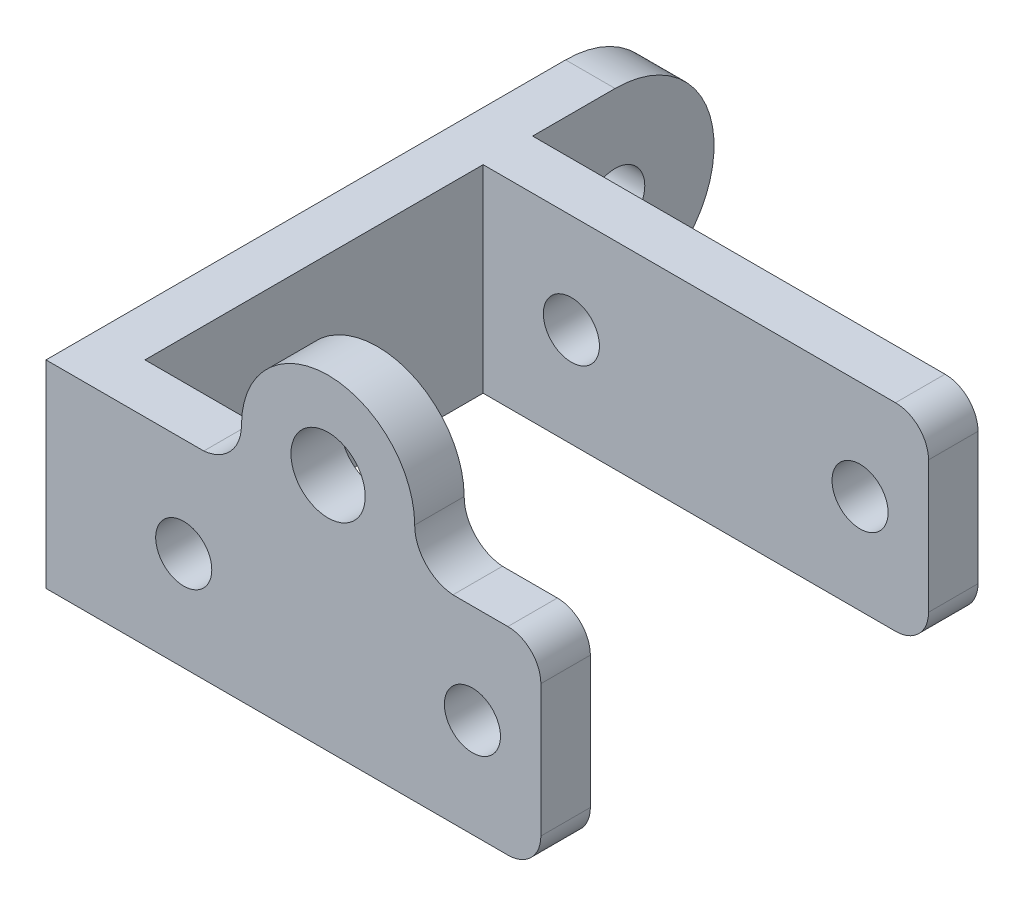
from build123d import *

# Parameters (mm, degrees)
SKETCH_2_W          = 30
SKETCH_2_H          = 12
EXTRUDE_1_DEPTH     = 26.5
SHELL_2_T           = -3
SKETCH_4_R          = 1.7
CUT_EXTRUDE_2_DEPTH = 32.036269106
EXTRUDE_START       = -3
EXTRUDE_2_DEPTH     = 3
SKETCH_7_R          = 1.8
EXTRUDE_3_DEPTH     = 3
FILLET_1_R          = 2
CUT_EXTRUDE_4_REACH = 44.665
SKETCH_5_R          = 2.25


with BuildPart() as part:
    # Sketch 2 → Extrude 1 (new body)
    with BuildSketch(Plane.XY):
        Rectangle(SKETCH_2_W, SKETCH_2_H)
    extrude(amount=EXTRUDE_1_DEPTH)

    # Shell 2
    shell_2_openings = [part.faces().sort_by_distance(p)[0] for p in [
        (0, -6, 13.25),
        (0, 6, 13.25),
        (15, 0, 13.25),
    ]]
    offset(amount=SHELL_2_T, openings=shell_2_openings, kind=Kind.INTERSECTION)

    # Sketch 4 → Cut-Extrude 2 (cut, through all)
    with BuildSketch(Plane.XY.offset(26.5)):
        with Locations((-6.65, 0)):
            Circle(SKETCH_4_R)
        with Locations((10.85, 0)):
            Circle(SKETCH_4_R)
    extrude(amount=-CUT_EXTRUDE_2_DEPTH, mode=Mode.SUBTRACT)

    # Sketch 6 → Extrude 2 (add)
    with BuildSketch(Plane.XY.offset(26.5).offset(EXTRUDE_START)):
        with BuildLine():
            Line((-5.433549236, 6), (9.669144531, 6))
            ThreePointArc((9.669144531, 6), (8.019063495, 6.794975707), (7.35, 8.5))
            ThreePointArc((7.35, 8.5), (2.1, 13.75), (-3.15, 8.5))
            ThreePointArc((-3.15, 8.5), (-3.806816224, 6.807029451), (-5.433549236, 6))
        make_face()
    extrude(amount=EXTRUDE_2_DEPTH)

    # Sketch 7 → Extrude 3 (add)
    with BuildSketch(Plane.ZY.offset(15)):
        with BuildLine():
            Line((-5, 6), (0, 6))
            Line((0, 6), (0, -6))
            Line((0, -6), (-5, -6))
            ThreePointArc((-5, -6), (-11, 0), (-5, 6))
        make_face()
        with Locations(Location((-5, 0, 0), (0, 0, 270))):
            Circle(SKETCH_7_R, mode=Mode.SUBTRACT)
    extrude(amount=-EXTRUDE_3_DEPTH)

    # Fillet 1
    fillet_1_edges = [part.edges().sort_by_distance(p)[0] for p in [
        (15, -6, 1.5),
        (15, 6, 1.5),
        (15, -6, 25),
        (15, 6, 25),
    ]]
    fillet(fillet_1_edges, radius=FILLET_1_R)

    # Sketch 5 → Cut-Extrude 4 (cut, up to next)
    with BuildSketch(Plane.XY.offset(26.5), mode=Mode.PRIVATE) as cut_extrude_4_sk1:
        with Locations((2.1, 8.5)):
            Circle(SKETCH_5_R)
    cut_extrude_4_tool1 = extrude(cut_extrude_4_sk1.sketch, amount=-CUT_EXTRUDE_4_REACH, mode=Mode.PRIVATE) & part.part
    add(cut_extrude_4_tool1.solids().sort_by_distance((2.1, 8.5, 26.5))[0], mode=Mode.SUBTRACT)


solid = part.part
